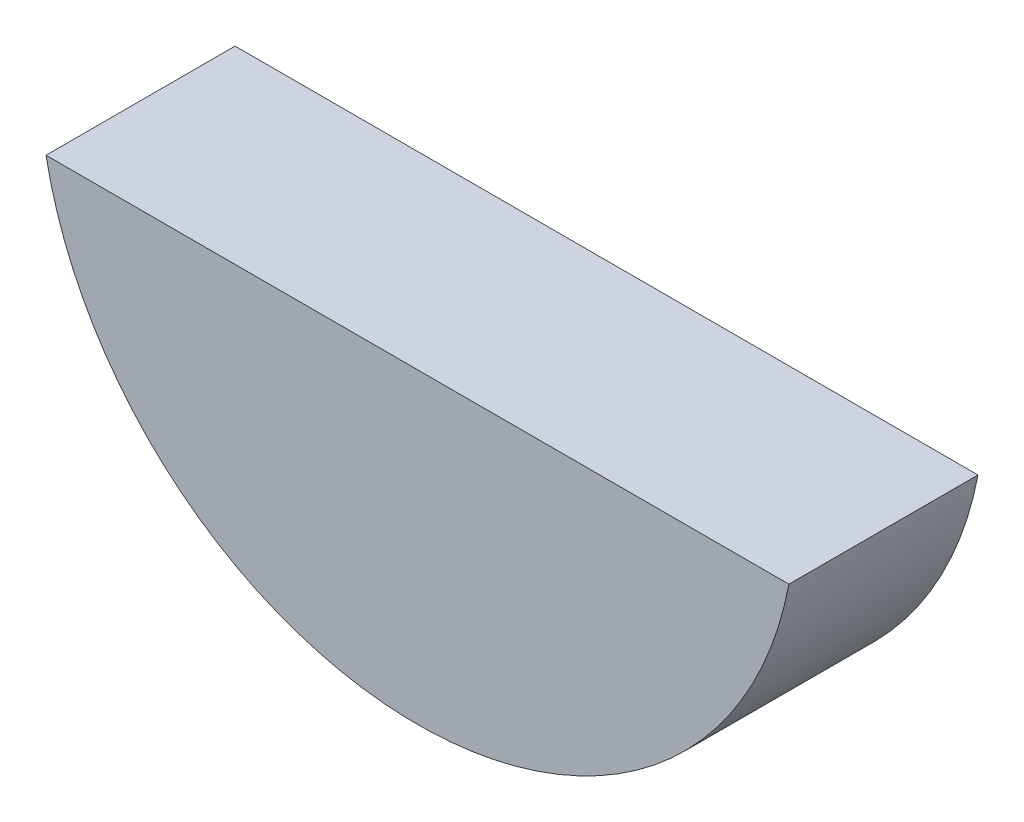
from build123d import *

# Parameters (mm, degrees)
BASE_EXTRUDE_DEPTH      = 1.5875
BASE_EXTRUDE_DEPTH_BACK = 1.5875


with BuildPart() as part:
    # Sketch1 → Base-Extrude (new, two sides: drawn at the far end of the back side and taken through both)
    with BuildSketch(Plane.XY.offset(-BASE_EXTRUDE_DEPTH_BACK)):
        with BuildLine():
            Line((-6.237380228, -1.190625), (6.237380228, -1.190625))
            ThreePointArc((6.237380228, -1.190625), (0, -6.35), (-6.237380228, -1.190625))
        make_face()
    extrude(amount=BASE_EXTRUDE_DEPTH + BASE_EXTRUDE_DEPTH_BACK)


solid = part.part
